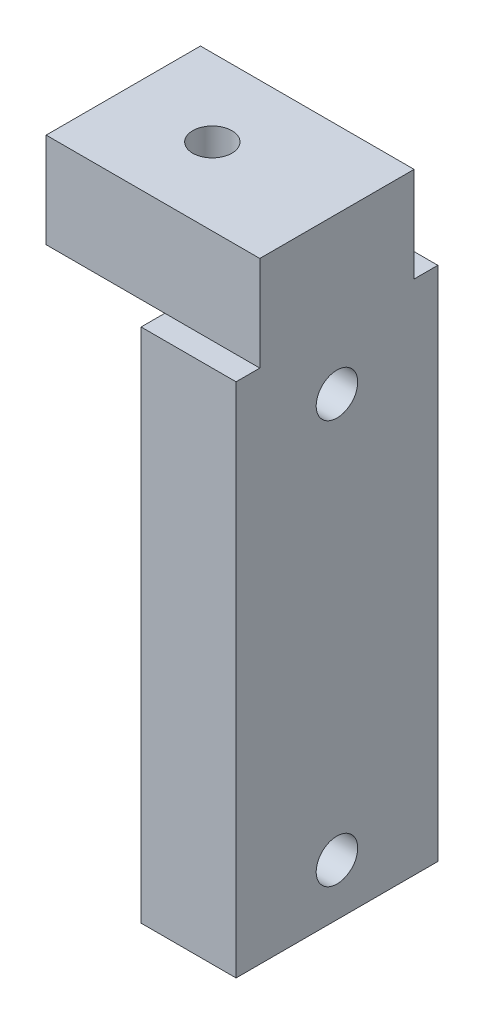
ISO-10303-21;
HEADER;
FILE_DESCRIPTION(('STEP AP214'),'2;1');
FILE_NAME('part.step','',(''),(''),'','','');
FILE_SCHEMA(('AUTOMOTIVE_DESIGN { 1 0 10303 214 1 1 1 1 }'));
ENDSEC;
DATA;
#1=APPLICATION_CONTEXT('core data for automotive mechanical design processes');
#2=APPLICATION_PROTOCOL_DEFINITION('international standard','automotive_design',2000,#1);
#3=PRODUCT_CONTEXT('',#1,'mechanical');
#4=PRODUCT('Part','Part','',(#3));
#5=PRODUCT_RELATED_PRODUCT_CATEGORY('part','',(#4));
#6=PRODUCT_DEFINITION_FORMATION('','',#4);
#7=PRODUCT_DEFINITION_CONTEXT('part definition',#1,'design');
#8=PRODUCT_DEFINITION('design','',#6,#7);
#9=PRODUCT_DEFINITION_SHAPE('','',#8);
#10=(LENGTH_UNIT() NAMED_UNIT(*) SI_UNIT(.MILLI.,.METRE.));
#11=(NAMED_UNIT(*) PLANE_ANGLE_UNIT() SI_UNIT($,.RADIAN.));
#12=(NAMED_UNIT(*) SI_UNIT($,.STERADIAN.) SOLID_ANGLE_UNIT());
#13=UNCERTAINTY_MEASURE_WITH_UNIT(LENGTH_MEASURE(1.E-05),#10,'distance_accuracy_value','');
#14=(GEOMETRIC_REPRESENTATION_CONTEXT(3) GLOBAL_UNCERTAINTY_ASSIGNED_CONTEXT((#13)) GLOBAL_UNIT_ASSIGNED_CONTEXT((#10,
#11,#12)) REPRESENTATION_CONTEXT('',''));
#15=CARTESIAN_POINT('',(0.,0.,0.));
#16=DIRECTION('',(0.,0.,1.));
#17=DIRECTION('',(1.,0.,0.));
#18=AXIS2_PLACEMENT_3D('',#15,#16,#17);
#19=CARTESIAN_POINT('',(0.,43.5,17.));
#20=DIRECTION('',(1.,0.,0.));
#21=DIRECTION('',(0.,0.,-1.));
#22=AXIS2_PLACEMENT_3D('',#19,#20,#21);
#23=PLANE('',#22);
#24=DIRECTION('',(0.,-1.,0.));
#25=VECTOR('',#24,1.);
#26=CARTESIAN_POINT('',(0.,43.5,15.));
#27=LINE('',#26,#25);
#28=CARTESIAN_POINT('',(0.,51.5,15.));
#29=VERTEX_POINT('',#28);
#30=CARTESIAN_POINT('',(0.,43.5,15.));
#31=VERTEX_POINT('',#30);
#32=EDGE_CURVE('E112',#29,#31,#27,.T.);
#33=ORIENTED_EDGE('',*,*,#32,.F.);
#34=DIRECTION('',(0.,0.,-1.));
#35=VECTOR('',#34,1.);
#36=CARTESIAN_POINT('',(0.,51.5,17.));
#37=LINE('',#36,#35);
#38=CARTESIAN_POINT('',(0.,51.5,2.));
#39=VERTEX_POINT('',#38);
#40=EDGE_CURVE('E147',#29,#39,#37,.T.);
#41=ORIENTED_EDGE('',*,*,#40,.T.);
#42=DIRECTION('',(0.,1.,0.));
#43=VECTOR('',#42,1.);
#44=CARTESIAN_POINT('',(0.,43.5,2.));
#45=LINE('',#44,#43);
#46=CARTESIAN_POINT('',(0.,43.5,2.));
#47=VERTEX_POINT('',#46);
#48=EDGE_CURVE('E123',#47,#39,#45,.T.);
#49=ORIENTED_EDGE('',*,*,#48,.F.);
#50=DIRECTION('',(0.,0.,-1.));
#51=VECTOR('',#50,1.);
#52=CARTESIAN_POINT('',(0.,43.5,17.));
#53=LINE('',#52,#51);
#54=EDGE_CURVE('E130',#31,#47,#53,.T.);
#55=ORIENTED_EDGE('',*,*,#54,.F.);
#56=EDGE_LOOP('',(#33,#41,#49,#55));
#57=FACE_BOUND('',#56,.T.);
#58=ADVANCED_FACE('F34',(#57),#23,.F.);
#59=CARTESIAN_POINT('',(0.,43.5,17.));
#60=DIRECTION('',(0.,1.,0.));
#61=DIRECTION('',(0.,0.,1.));
#62=AXIS2_PLACEMENT_3D('',#59,#60,#61);
#63=PLANE('',#62);
#64=CARTESIAN_POINT('',(7.50000000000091,43.5,8.5));
#65=DIRECTION('',(0.,1.,0.));
#66=DIRECTION('',(0.,0.,1.));
#67=AXIS2_PLACEMENT_3D('',#64,#65,#66);
#68=CIRCLE('',#67,1.65000000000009);
#69=CARTESIAN_POINT('',(7.50000000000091,43.5,10.1500000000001));
#70=VERTEX_POINT('',#69);
#71=EDGE_CURVE('E189',#70,#70,#68,.T.);
#72=ORIENTED_EDGE('',*,*,#71,.T.);
#73=EDGE_LOOP('',(#72));
#74=FACE_BOUND('',#73,.T.);
#75=DIRECTION('',(1.,0.,0.));
#76=VECTOR('',#75,1.);
#77=CARTESIAN_POINT('',(0.,43.5,15.));
#78=LINE('',#77,#76);
#79=CARTESIAN_POINT('',(10.,43.5,15.));
#80=VERTEX_POINT('',#79);
#81=EDGE_CURVE('E115',#31,#80,#78,.T.);
#82=ORIENTED_EDGE('',*,*,#81,.F.);
#83=ORIENTED_EDGE('',*,*,#54,.T.);
#84=DIRECTION('',(1.,0.,0.));
#85=VECTOR('',#84,1.);
#86=CARTESIAN_POINT('',(0.,43.5,2.));
#87=LINE('',#86,#85);
#88=CARTESIAN_POINT('',(10.,43.5,2.));
#89=VERTEX_POINT('',#88);
#90=EDGE_CURVE('E175',#47,#89,#87,.T.);
#91=ORIENTED_EDGE('',*,*,#90,.T.);
#92=DIRECTION('',(0.,0.,-1.));
#93=VECTOR('',#92,1.);
#94=CARTESIAN_POINT('',(10.,43.5,17.));
#95=LINE('',#94,#93);
#96=EDGE_CURVE('E132',#80,#89,#95,.T.);
#97=ORIENTED_EDGE('',*,*,#96,.F.);
#98=EDGE_LOOP('',(#82,#83,#91,#97));
#99=FACE_BOUND('',#98,.T.);
#100=ADVANCED_FACE('F128',(#74,#99),#63,.F.);
#101=CARTESIAN_POINT('',(18.,0.,17.));
#102=DIRECTION('',(-1.,0.,0.));
#103=DIRECTION('',(0.,0.,1.));
#104=AXIS2_PLACEMENT_3D('',#101,#102,#103);
#105=PLANE('',#104);
#106=CARTESIAN_POINT('',(18.,38.3582538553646,8.5));
#107=DIRECTION('',(1.,0.,0.));
#108=DIRECTION('',(0.,0.,-1.));
#109=AXIS2_PLACEMENT_3D('',#106,#107,#108);
#110=CIRCLE('',#109,1.75);
#111=CARTESIAN_POINT('',(18.,38.3582538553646,6.75));
#112=VERTEX_POINT('',#111);
#113=EDGE_CURVE('E170',#112,#112,#110,.T.);
#114=ORIENTED_EDGE('',*,*,#113,.F.);
#115=EDGE_LOOP('',(#114));
#116=FACE_BOUND('',#115,.T.);
#117=CARTESIAN_POINT('',(18.,4.35825385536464,8.5));
#118=DIRECTION('',(1.,0.,0.));
#119=DIRECTION('',(0.,0.,-1.));
#120=AXIS2_PLACEMENT_3D('',#117,#118,#119);
#121=CIRCLE('',#120,1.75);
#122=CARTESIAN_POINT('',(18.,4.35825385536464,6.75));
#123=VERTEX_POINT('',#122);
#124=EDGE_CURVE('E164',#123,#123,#121,.T.);
#125=ORIENTED_EDGE('',*,*,#124,.F.);
#126=EDGE_LOOP('',(#125));
#127=FACE_BOUND('',#126,.T.);
#128=DIRECTION('',(0.,1.,0.));
#129=VECTOR('',#128,1.);
#130=CARTESIAN_POINT('',(18.,43.5,2.));
#131=LINE('',#130,#129);
#132=CARTESIAN_POINT('',(18.,43.5,2.));
#133=VERTEX_POINT('',#132);
#134=CARTESIAN_POINT('',(18.,51.5,2.));
#135=VERTEX_POINT('',#134);
#136=EDGE_CURVE('E124',#133,#135,#131,.T.);
#137=ORIENTED_EDGE('',*,*,#136,.T.);
#138=DIRECTION('',(0.,0.,-1.));
#139=VECTOR('',#138,1.);
#140=CARTESIAN_POINT('',(18.,51.5,17.));
#141=LINE('',#140,#139);
#142=CARTESIAN_POINT('',(18.,51.5,15.));
#143=VERTEX_POINT('',#142);
#144=EDGE_CURVE('E144',#143,#135,#141,.T.);
#145=ORIENTED_EDGE('',*,*,#144,.F.);
#146=DIRECTION('',(0.,-1.,0.));
#147=VECTOR('',#146,1.);
#148=CARTESIAN_POINT('',(18.,43.5,15.));
#149=LINE('',#148,#147);
#150=CARTESIAN_POINT('',(18.,43.5,15.));
#151=VERTEX_POINT('',#150);
#152=EDGE_CURVE('E186',#143,#151,#149,.T.);
#153=ORIENTED_EDGE('',*,*,#152,.T.);
#154=DIRECTION('',(0.,0.,1.));
#155=VECTOR('',#154,1.);
#156=CARTESIAN_POINT('',(18.,43.5,15.));
#157=LINE('',#156,#155);
#158=CARTESIAN_POINT('',(18.,43.5,17.));
#159=VERTEX_POINT('',#158);
#160=EDGE_CURVE('E183',#151,#159,#157,.T.);
#161=ORIENTED_EDGE('',*,*,#160,.T.);
#162=DIRECTION('',(0.,1.,0.));
#163=VECTOR('',#162,1.);
#164=CARTESIAN_POINT('',(18.,0.,17.));
#165=LINE('',#164,#163);
#166=CARTESIAN_POINT('',(18.,0.,17.));
#167=VERTEX_POINT('',#166);
#168=EDGE_CURVE('E149',#167,#159,#165,.T.);
#169=ORIENTED_EDGE('',*,*,#168,.F.);
#170=DIRECTION('',(0.,0.,-1.));
#171=VECTOR('',#170,1.);
#172=CARTESIAN_POINT('',(18.,0.,17.));
#173=LINE('',#172,#171);
#174=CARTESIAN_POINT('',(18.,0.,0.));
#175=VERTEX_POINT('',#174);
#176=EDGE_CURVE('E142',#167,#175,#173,.T.);
#177=ORIENTED_EDGE('',*,*,#176,.T.);
#178=DIRECTION('',(0.,1.,0.));
#179=VECTOR('',#178,1.);
#180=CARTESIAN_POINT('',(18.,0.,0.));
#181=LINE('',#180,#179);
#182=CARTESIAN_POINT('',(18.,43.5,0.));
#183=VERTEX_POINT('',#182);
#184=EDGE_CURVE('E150',#175,#183,#181,.T.);
#185=ORIENTED_EDGE('',*,*,#184,.T.);
#186=DIRECTION('',(0.,0.,1.));
#187=VECTOR('',#186,1.);
#188=CARTESIAN_POINT('',(18.,43.5,0.));
#189=LINE('',#188,#187);
#190=EDGE_CURVE('E48',#183,#133,#189,.T.);
#191=ORIENTED_EDGE('',*,*,#190,.T.);
#192=EDGE_LOOP('',(#137,#145,#153,#161,#169,#177,#185,#191));
#193=FACE_BOUND('',#192,.T.);
#194=ADVANCED_FACE('F204',(#116,#127,#193),#105,.F.);
#195=CARTESIAN_POINT('',(0.,51.5,17.));
#196=DIRECTION('',(0.,-1.,0.));
#197=DIRECTION('',(0.,0.,-1.));
#198=AXIS2_PLACEMENT_3D('',#195,#196,#197);
#199=PLANE('',#198);
#200=CARTESIAN_POINT('',(7.50000000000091,51.5,8.5));
#201=DIRECTION('',(0.,1.,0.));
#202=DIRECTION('',(0.,0.,1.));
#203=AXIS2_PLACEMENT_3D('',#200,#201,#202);
#204=CIRCLE('',#203,1.65000000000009);
#205=CARTESIAN_POINT('',(7.50000000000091,51.5,10.1500000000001));
#206=VERTEX_POINT('',#205);
#207=EDGE_CURVE('E193',#206,#206,#204,.T.);
#208=ORIENTED_EDGE('',*,*,#207,.F.);
#209=EDGE_LOOP('',(#208));
#210=FACE_BOUND('',#209,.T.);
#211=DIRECTION('',(1.,0.,0.));
#212=VECTOR('',#211,1.);
#213=CARTESIAN_POINT('',(0.,51.5,15.));
#214=LINE('',#213,#212);
#215=EDGE_CURVE('E118',#29,#143,#214,.T.);
#216=ORIENTED_EDGE('',*,*,#215,.T.);
#217=ORIENTED_EDGE('',*,*,#144,.T.);
#218=DIRECTION('',(1.,0.,0.));
#219=VECTOR('',#218,1.);
#220=CARTESIAN_POINT('',(0.,51.5,2.));
#221=LINE('',#220,#219);
#222=EDGE_CURVE('E177',#39,#135,#221,.T.);
#223=ORIENTED_EDGE('',*,*,#222,.F.);
#224=ORIENTED_EDGE('',*,*,#40,.F.);
#225=EDGE_LOOP('',(#216,#217,#223,#224));
#226=FACE_BOUND('',#225,.T.);
#227=ADVANCED_FACE('F200',(#210,#226),#199,.F.);
#228=CARTESIAN_POINT('',(0.,51.5,17.));
#229=DIRECTION('',(0.,0.,-1.));
#230=DIRECTION('',(-1.,0.,0.));
#231=AXIS2_PLACEMENT_3D('',#228,#229,#230);
#232=PLANE('',#231);
#233=DIRECTION('',(1.,0.,0.));
#234=VECTOR('',#233,1.);
#235=CARTESIAN_POINT('',(0.,43.5,17.));
#236=LINE('',#235,#234);
#237=CARTESIAN_POINT('',(10.,43.5,17.));
#238=VERTEX_POINT('',#237);
#239=EDGE_CURVE('E12',#238,#159,#236,.T.);
#240=ORIENTED_EDGE('',*,*,#239,.F.);
#241=DIRECTION('',(0.,-1.,0.));
#242=VECTOR('',#241,1.);
#243=CARTESIAN_POINT('',(10.,0.,17.));
#244=LINE('',#243,#242);
#245=CARTESIAN_POINT('',(10.,0.,17.));
#246=VERTEX_POINT('',#245);
#247=EDGE_CURVE('E153',#238,#246,#244,.T.);
#248=ORIENTED_EDGE('',*,*,#247,.T.);
#249=DIRECTION('',(1.,0.,0.));
#250=VECTOR('',#249,1.);
#251=CARTESIAN_POINT('',(10.,0.,17.));
#252=LINE('',#251,#250);
#253=EDGE_CURVE('E57',#246,#167,#252,.T.);
#254=ORIENTED_EDGE('',*,*,#253,.T.);
#255=ORIENTED_EDGE('',*,*,#168,.T.);
#256=EDGE_LOOP('',(#240,#248,#254,#255));
#257=FACE_BOUND('',#256,.T.);
#258=ADVANCED_FACE('F203',(#257),#232,.F.);
#259=CARTESIAN_POINT('',(0.,51.5,0.));
#260=DIRECTION('',(0.,0.,-1.));
#261=DIRECTION('',(-1.,0.,0.));
#262=AXIS2_PLACEMENT_3D('',#259,#260,#261);
#263=PLANE('',#262);
#264=DIRECTION('',(0.,-1.,0.));
#265=VECTOR('',#264,1.);
#266=CARTESIAN_POINT('',(10.,0.,0.));
#267=LINE('',#266,#265);
#268=CARTESIAN_POINT('',(10.,43.5,0.));
#269=VERTEX_POINT('',#268);
#270=CARTESIAN_POINT('',(10.,0.,0.));
#271=VERTEX_POINT('',#270);
#272=EDGE_CURVE('E155',#269,#271,#267,.T.);
#273=ORIENTED_EDGE('',*,*,#272,.F.);
#274=DIRECTION('',(1.,0.,0.));
#275=VECTOR('',#274,1.);
#276=CARTESIAN_POINT('',(0.,43.5,0.));
#277=LINE('',#276,#275);
#278=EDGE_CURVE('E41',#269,#183,#277,.T.);
#279=ORIENTED_EDGE('',*,*,#278,.T.);
#280=ORIENTED_EDGE('',*,*,#184,.F.);
#281=DIRECTION('',(1.,0.,0.));
#282=VECTOR('',#281,1.);
#283=CARTESIAN_POINT('',(10.,0.,0.));
#284=LINE('',#283,#282);
#285=EDGE_CURVE('E70',#271,#175,#284,.T.);
#286=ORIENTED_EDGE('',*,*,#285,.F.);
#287=EDGE_LOOP('',(#273,#279,#280,#286));
#288=FACE_BOUND('',#287,.T.);
#289=ADVANCED_FACE('F225',(#288),#263,.T.);
#290=CARTESIAN_POINT('',(10.,0.,17.));
#291=DIRECTION('',(1.,0.,0.));
#292=DIRECTION('',(0.,0.,-1.));
#293=AXIS2_PLACEMENT_3D('',#290,#291,#292);
#294=PLANE('',#293);
#295=EDGE_CURVE('E76',#238,#80,#95,.T.);
#296=ORIENTED_EDGE('',*,*,#295,.T.);
#297=ORIENTED_EDGE('',*,*,#96,.T.);
#298=DIRECTION('',(0.,0.,1.));
#299=VECTOR('',#298,1.);
#300=CARTESIAN_POINT('',(10.,43.5,17.));
#301=LINE('',#300,#299);
#302=EDGE_CURVE('E173',#269,#89,#301,.T.);
#303=ORIENTED_EDGE('',*,*,#302,.F.);
#304=ORIENTED_EDGE('',*,*,#272,.T.);
#305=DIRECTION('',(0.,0.,-1.));
#306=VECTOR('',#305,1.);
#307=CARTESIAN_POINT('',(10.,0.,17.));
#308=LINE('',#307,#306);
#309=EDGE_CURVE('E140',#246,#271,#308,.T.);
#310=ORIENTED_EDGE('',*,*,#309,.F.);
#311=ORIENTED_EDGE('',*,*,#247,.F.);
#312=EDGE_LOOP('',(#296,#297,#303,#304,#310,#311));
#313=FACE_BOUND('',#312,.T.);
#314=CARTESIAN_POINT('',(10.,38.3582538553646,8.5));
#315=DIRECTION('',(1.,0.,0.));
#316=DIRECTION('',(0.,0.,-1.));
#317=AXIS2_PLACEMENT_3D('',#314,#315,#316);
#318=CIRCLE('',#317,1.75);
#319=CARTESIAN_POINT('',(10.,38.3582538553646,6.75));
#320=VERTEX_POINT('',#319);
#321=EDGE_CURVE('E167',#320,#320,#318,.T.);
#322=ORIENTED_EDGE('',*,*,#321,.T.);
#323=EDGE_LOOP('',(#322));
#324=FACE_BOUND('',#323,.T.);
#325=CARTESIAN_POINT('',(10.,4.35825385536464,8.5));
#326=DIRECTION('',(1.,0.,0.));
#327=DIRECTION('',(0.,0.,-1.));
#328=AXIS2_PLACEMENT_3D('',#325,#326,#327);
#329=CIRCLE('',#328,1.75);
#330=CARTESIAN_POINT('',(10.,4.35825385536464,6.75));
#331=VERTEX_POINT('',#330);
#332=EDGE_CURVE('E158',#331,#331,#329,.T.);
#333=ORIENTED_EDGE('',*,*,#332,.T.);
#334=EDGE_LOOP('',(#333));
#335=FACE_BOUND('',#334,.T.);
#336=ADVANCED_FACE('F216',(#313,#324,#335),#294,.F.);
#337=CARTESIAN_POINT('',(10.,0.,17.));
#338=DIRECTION('',(0.,1.,0.));
#339=DIRECTION('',(0.,0.,1.));
#340=AXIS2_PLACEMENT_3D('',#337,#338,#339);
#341=PLANE('',#340);
#342=ORIENTED_EDGE('',*,*,#285,.T.);
#343=ORIENTED_EDGE('',*,*,#176,.F.);
#344=ORIENTED_EDGE('',*,*,#253,.F.);
#345=ORIENTED_EDGE('',*,*,#309,.T.);
#346=EDGE_LOOP('',(#342,#343,#344,#345));
#347=FACE_BOUND('',#346,.T.);
#348=ADVANCED_FACE('F252',(#347),#341,.F.);
#349=CARTESIAN_POINT('',(0.,4.35825385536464,8.5));
#350=DIRECTION('',(1.,0.,0.));
#351=DIRECTION('',(0.,0.,-1.));
#352=AXIS2_PLACEMENT_3D('',#349,#350,#351);
#353=CYLINDRICAL_SURFACE('',#352,1.75);
#354=ORIENTED_EDGE('',*,*,#124,.T.);
#355=EDGE_LOOP('',(#354));
#356=FACE_BOUND('',#355,.T.);
#357=ORIENTED_EDGE('',*,*,#332,.F.);
#358=EDGE_LOOP('',(#357));
#359=FACE_BOUND('',#358,.T.);
#360=ADVANCED_FACE('F235',(#356,#359),#353,.F.);
#361=CARTESIAN_POINT('',(0.,38.3582538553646,8.5));
#362=DIRECTION('',(1.,0.,0.));
#363=DIRECTION('',(0.,0.,-1.));
#364=AXIS2_PLACEMENT_3D('',#361,#362,#363);
#365=CYLINDRICAL_SURFACE('',#364,1.75);
#366=ORIENTED_EDGE('',*,*,#113,.T.);
#367=EDGE_LOOP('',(#366));
#368=FACE_BOUND('',#367,.T.);
#369=ORIENTED_EDGE('',*,*,#321,.F.);
#370=EDGE_LOOP('',(#369));
#371=FACE_BOUND('',#370,.T.);
#372=ADVANCED_FACE('F228',(#368,#371),#365,.F.);
#373=CARTESIAN_POINT('',(0.,43.5,0.));
#374=DIRECTION('',(0.,1.,0.));
#375=DIRECTION('',(0.,0.,1.));
#376=AXIS2_PLACEMENT_3D('',#373,#374,#375);
#377=PLANE('',#376);
#378=ORIENTED_EDGE('',*,*,#302,.T.);
#379=EDGE_CURVE('E133',#89,#133,#87,.T.);
#380=ORIENTED_EDGE('',*,*,#379,.T.);
#381=ORIENTED_EDGE('',*,*,#190,.F.);
#382=ORIENTED_EDGE('',*,*,#278,.F.);
#383=EDGE_LOOP('',(#378,#380,#381,#382));
#384=FACE_BOUND('',#383,.T.);
#385=ADVANCED_FACE('F226',(#384),#377,.T.);
#386=CARTESIAN_POINT('',(0.,43.5,2.));
#387=DIRECTION('',(0.,0.,-1.));
#388=DIRECTION('',(-1.,0.,0.));
#389=AXIS2_PLACEMENT_3D('',#386,#387,#388);
#390=PLANE('',#389);
#391=ORIENTED_EDGE('',*,*,#222,.T.);
#392=ORIENTED_EDGE('',*,*,#136,.F.);
#393=ORIENTED_EDGE('',*,*,#379,.F.);
#394=ORIENTED_EDGE('',*,*,#90,.F.);
#395=ORIENTED_EDGE('',*,*,#48,.T.);
#396=EDGE_LOOP('',(#391,#392,#393,#394,#395));
#397=FACE_BOUND('',#396,.T.);
#398=ADVANCED_FACE('F213',(#397),#390,.T.);
#399=CARTESIAN_POINT('',(0.,43.5,15.));
#400=DIRECTION('',(0.,1.,0.));
#401=DIRECTION('',(0.,0.,1.));
#402=AXIS2_PLACEMENT_3D('',#399,#400,#401);
#403=PLANE('',#402);
#404=ORIENTED_EDGE('',*,*,#295,.F.);
#405=ORIENTED_EDGE('',*,*,#239,.T.);
#406=ORIENTED_EDGE('',*,*,#160,.F.);
#407=EDGE_CURVE('E134',#80,#151,#78,.T.);
#408=ORIENTED_EDGE('',*,*,#407,.F.);
#409=EDGE_LOOP('',(#404,#405,#406,#408));
#410=FACE_BOUND('',#409,.T.);
#411=ADVANCED_FACE('F222',(#410),#403,.T.);
#412=CARTESIAN_POINT('',(0.,43.5,15.));
#413=DIRECTION('',(0.,0.,1.));
#414=DIRECTION('',(1.,0.,0.));
#415=AXIS2_PLACEMENT_3D('',#412,#413,#414);
#416=PLANE('',#415);
#417=ORIENTED_EDGE('',*,*,#81,.T.);
#418=ORIENTED_EDGE('',*,*,#407,.T.);
#419=ORIENTED_EDGE('',*,*,#152,.F.);
#420=ORIENTED_EDGE('',*,*,#215,.F.);
#421=ORIENTED_EDGE('',*,*,#32,.T.);
#422=EDGE_LOOP('',(#417,#418,#419,#420,#421));
#423=FACE_BOUND('',#422,.T.);
#424=ADVANCED_FACE('F114',(#423),#416,.T.);
#425=CARTESIAN_POINT('',(7.50000000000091,0.,8.5));
#426=DIRECTION('',(0.,1.,0.));
#427=DIRECTION('',(0.,0.,1.));
#428=AXIS2_PLACEMENT_3D('',#425,#426,#427);
#429=CYLINDRICAL_SURFACE('',#428,1.65000000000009);
#430=ORIENTED_EDGE('',*,*,#207,.T.);
#431=EDGE_LOOP('',(#430));
#432=FACE_BOUND('',#431,.T.);
#433=ORIENTED_EDGE('',*,*,#71,.F.);
#434=EDGE_LOOP('',(#433));
#435=FACE_BOUND('',#434,.T.);
#436=ADVANCED_FACE('F197',(#432,#435),#429,.F.);
#437=CLOSED_SHELL('',(#58,#100,#194,#227,#258,#289,#336,#348,#360,#372,#385,#398,#411,#424,#436));
#438=MANIFOLD_SOLID_BREP('B2',#437);
#439=ADVANCED_BREP_SHAPE_REPRESENTATION('',(#18,#438),#14);
#440=SHAPE_DEFINITION_REPRESENTATION(#9,#439);
ENDSEC;
END-ISO-10303-21;
